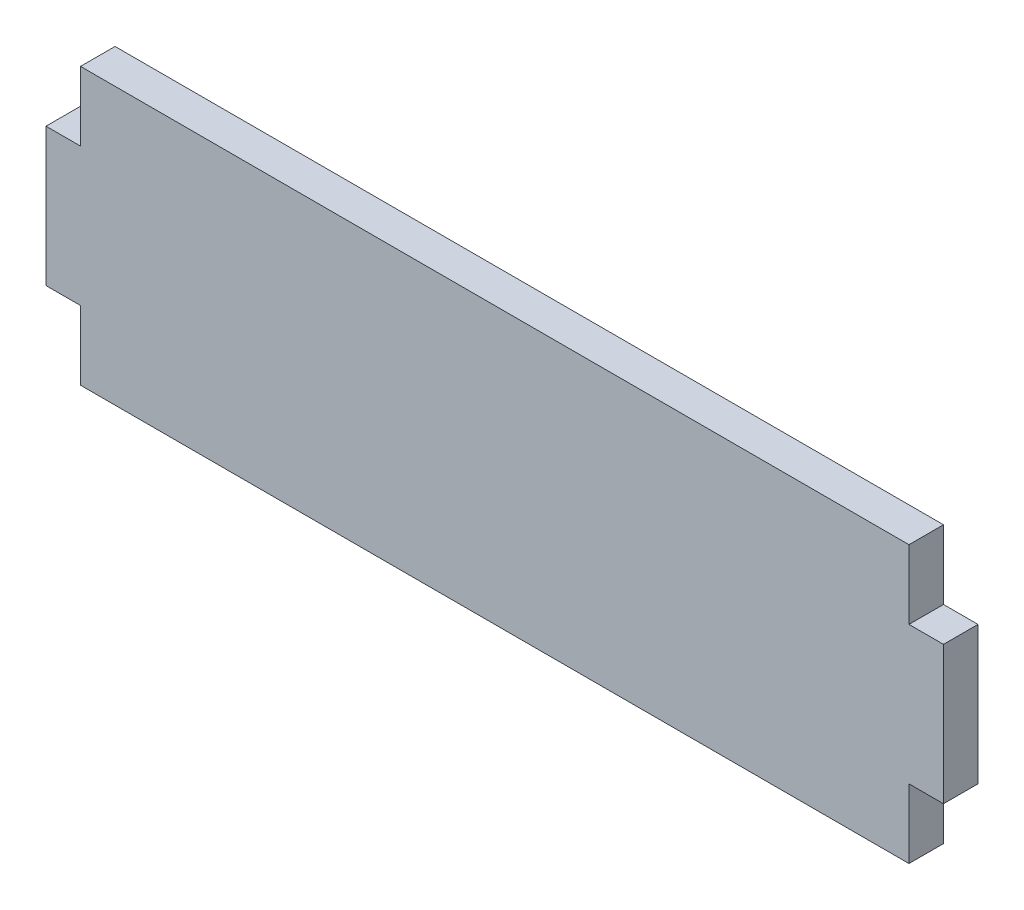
ISO-10303-21;
HEADER;
FILE_DESCRIPTION(('STEP AP214'),'2;1');
FILE_NAME('part.step','',(''),(''),'','','');
FILE_SCHEMA(('AUTOMOTIVE_DESIGN { 1 0 10303 214 1 1 1 1 }'));
ENDSEC;
DATA;
#1=APPLICATION_CONTEXT('core data for automotive mechanical design processes');
#2=APPLICATION_PROTOCOL_DEFINITION('international standard','automotive_design',2000,#1);
#3=PRODUCT_CONTEXT('',#1,'mechanical');
#4=PRODUCT('Part','Part','',(#3));
#5=PRODUCT_RELATED_PRODUCT_CATEGORY('part','',(#4));
#6=PRODUCT_DEFINITION_FORMATION('','',#4);
#7=PRODUCT_DEFINITION_CONTEXT('part definition',#1,'design');
#8=PRODUCT_DEFINITION('design','',#6,#7);
#9=PRODUCT_DEFINITION_SHAPE('','',#8);
#10=(LENGTH_UNIT() NAMED_UNIT(*) SI_UNIT(.MILLI.,.METRE.));
#11=(NAMED_UNIT(*) PLANE_ANGLE_UNIT() SI_UNIT($,.RADIAN.));
#12=(NAMED_UNIT(*) SI_UNIT($,.STERADIAN.) SOLID_ANGLE_UNIT());
#13=UNCERTAINTY_MEASURE_WITH_UNIT(LENGTH_MEASURE(1.E-05),#10,'distance_accuracy_value','');
#14=(GEOMETRIC_REPRESENTATION_CONTEXT(3) GLOBAL_UNCERTAINTY_ASSIGNED_CONTEXT((#13)) GLOBAL_UNIT_ASSIGNED_CONTEXT((#10,
#11,#12)) REPRESENTATION_CONTEXT('',''));
#15=CARTESIAN_POINT('',(0.,0.,0.));
#16=DIRECTION('',(0.,0.,1.));
#17=DIRECTION('',(1.,0.,0.));
#18=AXIS2_PLACEMENT_3D('',#15,#16,#17);
#19=CARTESIAN_POINT('',(0.,-12.7,3.175));
#20=DIRECTION('',(0.,1.,0.));
#21=DIRECTION('',(0.,0.,1.));
#22=AXIS2_PLACEMENT_3D('',#19,#20,#21);
#23=PLANE('',#22);
#24=DIRECTION('',(1.,0.,0.));
#25=VECTOR('',#24,1.);
#26=CARTESIAN_POINT('',(0.,-12.7,0.));
#27=LINE('',#26,#25);
#28=CARTESIAN_POINT('',(-38.1,-12.7,0.));
#29=VERTEX_POINT('',#28);
#30=CARTESIAN_POINT('',(38.1,-12.7,0.));
#31=VERTEX_POINT('',#30);
#32=EDGE_CURVE('E155',#29,#31,#27,.T.);
#33=ORIENTED_EDGE('',*,*,#32,.T.);
#34=DIRECTION('',(0.,0.,-1.));
#35=VECTOR('',#34,1.);
#36=CARTESIAN_POINT('',(38.1,-12.7,3.175));
#37=LINE('',#36,#35);
#38=CARTESIAN_POINT('',(38.1,-12.7,3.175));
#39=VERTEX_POINT('',#38);
#40=EDGE_CURVE('E11',#39,#31,#37,.T.);
#41=ORIENTED_EDGE('',*,*,#40,.F.);
#42=DIRECTION('',(1.,0.,0.));
#43=VECTOR('',#42,1.);
#44=CARTESIAN_POINT('',(0.,-12.7,3.175));
#45=LINE('',#44,#43);
#46=CARTESIAN_POINT('',(-38.1,-12.7,3.175));
#47=VERTEX_POINT('',#46);
#48=EDGE_CURVE('E186',#47,#39,#45,.T.);
#49=ORIENTED_EDGE('',*,*,#48,.F.);
#50=DIRECTION('',(0.,0.,-1.));
#51=VECTOR('',#50,1.);
#52=CARTESIAN_POINT('',(-38.1,-12.7,3.175));
#53=LINE('',#52,#51);
#54=EDGE_CURVE('E49',#47,#29,#53,.T.);
#55=ORIENTED_EDGE('',*,*,#54,.T.);
#56=EDGE_LOOP('',(#33,#41,#49,#55));
#57=FACE_BOUND('',#56,.T.);
#58=ADVANCED_FACE('F33',(#57),#23,.F.);
#59=CARTESIAN_POINT('',(38.1,0.,3.175));
#60=DIRECTION('',(-1.,0.,0.));
#61=DIRECTION('',(0.,0.,1.));
#62=AXIS2_PLACEMENT_3D('',#59,#60,#61);
#63=PLANE('',#62);
#64=DIRECTION('',(0.,1.,0.));
#65=VECTOR('',#64,1.);
#66=CARTESIAN_POINT('',(38.1,0.,0.));
#67=LINE('',#66,#65);
#68=CARTESIAN_POINT('',(38.1,-6.35,0.));
#69=VERTEX_POINT('',#68);
#70=EDGE_CURVE('E157',#31,#69,#67,.T.);
#71=ORIENTED_EDGE('',*,*,#70,.T.);
#72=DIRECTION('',(0.,0.,-1.));
#73=VECTOR('',#72,1.);
#74=CARTESIAN_POINT('',(38.1,-6.35,3.175));
#75=LINE('',#74,#73);
#76=CARTESIAN_POINT('',(38.1,-6.35,3.175));
#77=VERTEX_POINT('',#76);
#78=EDGE_CURVE('E41',#77,#69,#75,.T.);
#79=ORIENTED_EDGE('',*,*,#78,.F.);
#80=DIRECTION('',(0.,1.,0.));
#81=VECTOR('',#80,1.);
#82=CARTESIAN_POINT('',(38.1,0.,3.175));
#83=LINE('',#82,#81);
#84=EDGE_CURVE('E100',#39,#77,#83,.T.);
#85=ORIENTED_EDGE('',*,*,#84,.F.);
#86=ORIENTED_EDGE('',*,*,#40,.T.);
#87=EDGE_LOOP('',(#71,#79,#85,#86));
#88=FACE_BOUND('',#87,.T.);
#89=ADVANCED_FACE('F208',(#88),#63,.F.);
#90=CARTESIAN_POINT('',(0.,-6.35,3.175));
#91=DIRECTION('',(0.,-1.,0.));
#92=DIRECTION('',(0.,0.,-1.));
#93=AXIS2_PLACEMENT_3D('',#90,#91,#92);
#94=PLANE('',#93);
#95=DIRECTION('',(-1.,0.,0.));
#96=VECTOR('',#95,1.);
#97=CARTESIAN_POINT('',(0.,-6.35,0.));
#98=LINE('',#97,#96);
#99=CARTESIAN_POINT('',(41.275,-6.35,0.));
#100=VERTEX_POINT('',#99);
#101=EDGE_CURVE('E160',#100,#69,#98,.T.);
#102=ORIENTED_EDGE('',*,*,#101,.F.);
#103=DIRECTION('',(0.,0.,-1.));
#104=VECTOR('',#103,1.);
#105=CARTESIAN_POINT('',(41.275,-6.35,3.175));
#106=LINE('',#105,#104);
#107=CARTESIAN_POINT('',(41.275,-6.35,3.175));
#108=VERTEX_POINT('',#107);
#109=EDGE_CURVE('E201',#108,#100,#106,.T.);
#110=ORIENTED_EDGE('',*,*,#109,.F.);
#111=DIRECTION('',(-1.,0.,0.));
#112=VECTOR('',#111,1.);
#113=CARTESIAN_POINT('',(0.,-6.35,3.175));
#114=LINE('',#113,#112);
#115=EDGE_CURVE('E207',#108,#77,#114,.T.);
#116=ORIENTED_EDGE('',*,*,#115,.T.);
#117=ORIENTED_EDGE('',*,*,#78,.T.);
#118=EDGE_LOOP('',(#102,#110,#116,#117));
#119=FACE_BOUND('',#118,.T.);
#120=ADVANCED_FACE('F205',(#119),#94,.T.);
#121=CARTESIAN_POINT('',(41.275,0.,3.175));
#122=DIRECTION('',(-1.,0.,0.));
#123=DIRECTION('',(0.,0.,1.));
#124=AXIS2_PLACEMENT_3D('',#121,#122,#123);
#125=PLANE('',#124);
#126=DIRECTION('',(0.,1.,0.));
#127=VECTOR('',#126,1.);
#128=CARTESIAN_POINT('',(41.275,0.,0.));
#129=LINE('',#128,#127);
#130=CARTESIAN_POINT('',(41.275,6.35,0.));
#131=VERTEX_POINT('',#130);
#132=EDGE_CURVE('E163',#100,#131,#129,.T.);
#133=ORIENTED_EDGE('',*,*,#132,.T.);
#134=DIRECTION('',(0.,0.,-1.));
#135=VECTOR('',#134,1.);
#136=CARTESIAN_POINT('',(41.275,6.35,3.175));
#137=LINE('',#136,#135);
#138=CARTESIAN_POINT('',(41.275,6.35,3.175));
#139=VERTEX_POINT('',#138);
#140=EDGE_CURVE('E198',#139,#131,#137,.T.);
#141=ORIENTED_EDGE('',*,*,#140,.F.);
#142=DIRECTION('',(0.,1.,0.));
#143=VECTOR('',#142,1.);
#144=CARTESIAN_POINT('',(41.275,0.,3.175));
#145=LINE('',#144,#143);
#146=EDGE_CURVE('E226',#108,#139,#145,.T.);
#147=ORIENTED_EDGE('',*,*,#146,.F.);
#148=ORIENTED_EDGE('',*,*,#109,.T.);
#149=EDGE_LOOP('',(#133,#141,#147,#148));
#150=FACE_BOUND('',#149,.T.);
#151=ADVANCED_FACE('F216',(#150),#125,.F.);
#152=CARTESIAN_POINT('',(0.,6.35,3.175));
#153=DIRECTION('',(0.,-1.,0.));
#154=DIRECTION('',(0.,0.,-1.));
#155=AXIS2_PLACEMENT_3D('',#152,#153,#154);
#156=PLANE('',#155);
#157=DIRECTION('',(-1.,0.,0.));
#158=VECTOR('',#157,1.);
#159=CARTESIAN_POINT('',(0.,6.35,0.));
#160=LINE('',#159,#158);
#161=CARTESIAN_POINT('',(38.1,6.35,0.));
#162=VERTEX_POINT('',#161);
#163=EDGE_CURVE('E165',#131,#162,#160,.T.);
#164=ORIENTED_EDGE('',*,*,#163,.T.);
#165=DIRECTION('',(0.,0.,-1.));
#166=VECTOR('',#165,1.);
#167=CARTESIAN_POINT('',(38.1,6.35,3.175));
#168=LINE('',#167,#166);
#169=CARTESIAN_POINT('',(38.1,6.35,3.175));
#170=VERTEX_POINT('',#169);
#171=EDGE_CURVE('E196',#170,#162,#168,.T.);
#172=ORIENTED_EDGE('',*,*,#171,.F.);
#173=DIRECTION('',(-1.,0.,0.));
#174=VECTOR('',#173,1.);
#175=CARTESIAN_POINT('',(0.,6.35,3.175));
#176=LINE('',#175,#174);
#177=EDGE_CURVE('E222',#139,#170,#176,.T.);
#178=ORIENTED_EDGE('',*,*,#177,.F.);
#179=ORIENTED_EDGE('',*,*,#140,.T.);
#180=EDGE_LOOP('',(#164,#172,#178,#179));
#181=FACE_BOUND('',#180,.T.);
#182=ADVANCED_FACE('F220',(#181),#156,.F.);
#183=CARTESIAN_POINT('',(38.1,0.,3.175));
#184=DIRECTION('',(1.,0.,0.));
#185=DIRECTION('',(0.,0.,-1.));
#186=AXIS2_PLACEMENT_3D('',#183,#184,#185);
#187=PLANE('',#186);
#188=DIRECTION('',(0.,-1.,0.));
#189=VECTOR('',#188,1.);
#190=CARTESIAN_POINT('',(38.1,0.,0.));
#191=LINE('',#190,#189);
#192=CARTESIAN_POINT('',(38.1,12.7,0.));
#193=VERTEX_POINT('',#192);
#194=EDGE_CURVE('E168',#193,#162,#191,.T.);
#195=ORIENTED_EDGE('',*,*,#194,.F.);
#196=DIRECTION('',(0.,0.,-1.));
#197=VECTOR('',#196,1.);
#198=CARTESIAN_POINT('',(38.1,12.7,3.175));
#199=LINE('',#198,#197);
#200=CARTESIAN_POINT('',(38.1,12.7,3.175));
#201=VERTEX_POINT('',#200);
#202=EDGE_CURVE('E194',#201,#193,#199,.T.);
#203=ORIENTED_EDGE('',*,*,#202,.F.);
#204=DIRECTION('',(0.,-1.,0.));
#205=VECTOR('',#204,1.);
#206=CARTESIAN_POINT('',(38.1,0.,3.175));
#207=LINE('',#206,#205);
#208=EDGE_CURVE('E225',#201,#170,#207,.T.);
#209=ORIENTED_EDGE('',*,*,#208,.T.);
#210=ORIENTED_EDGE('',*,*,#171,.T.);
#211=EDGE_LOOP('',(#195,#203,#209,#210));
#212=FACE_BOUND('',#211,.T.);
#213=ADVANCED_FACE('F268',(#212),#187,.T.);
#214=CARTESIAN_POINT('',(0.,12.7,3.175));
#215=DIRECTION('',(0.,1.,0.));
#216=DIRECTION('',(0.,0.,1.));
#217=AXIS2_PLACEMENT_3D('',#214,#215,#216);
#218=PLANE('',#217);
#219=DIRECTION('',(1.,0.,0.));
#220=VECTOR('',#219,1.);
#221=CARTESIAN_POINT('',(0.,12.7,0.));
#222=LINE('',#221,#220);
#223=CARTESIAN_POINT('',(-38.1,12.7,0.));
#224=VERTEX_POINT('',#223);
#225=EDGE_CURVE('E171',#224,#193,#222,.T.);
#226=ORIENTED_EDGE('',*,*,#225,.F.);
#227=DIRECTION('',(0.,0.,-1.));
#228=VECTOR('',#227,1.);
#229=CARTESIAN_POINT('',(-38.1,12.7,3.175));
#230=LINE('',#229,#228);
#231=CARTESIAN_POINT('',(-38.1,12.7,3.175));
#232=VERTEX_POINT('',#231);
#233=EDGE_CURVE('E192',#232,#224,#230,.T.);
#234=ORIENTED_EDGE('',*,*,#233,.F.);
#235=DIRECTION('',(1.,0.,0.));
#236=VECTOR('',#235,1.);
#237=CARTESIAN_POINT('',(0.,12.7,3.175));
#238=LINE('',#237,#236);
#239=EDGE_CURVE('E228',#232,#201,#238,.T.);
#240=ORIENTED_EDGE('',*,*,#239,.T.);
#241=ORIENTED_EDGE('',*,*,#202,.T.);
#242=EDGE_LOOP('',(#226,#234,#240,#241));
#243=FACE_BOUND('',#242,.T.);
#244=ADVANCED_FACE('F271',(#243),#218,.T.);
#245=CARTESIAN_POINT('',(-38.1,0.,3.175));
#246=DIRECTION('',(1.,0.,0.));
#247=DIRECTION('',(0.,0.,-1.));
#248=AXIS2_PLACEMENT_3D('',#245,#246,#247);
#249=PLANE('',#248);
#250=DIRECTION('',(0.,-1.,0.));
#251=VECTOR('',#250,1.);
#252=CARTESIAN_POINT('',(-38.1,0.,0.));
#253=LINE('',#252,#251);
#254=CARTESIAN_POINT('',(-38.1,6.35,0.));
#255=VERTEX_POINT('',#254);
#256=EDGE_CURVE('E174',#224,#255,#253,.T.);
#257=ORIENTED_EDGE('',*,*,#256,.T.);
#258=DIRECTION('',(0.,0.,-1.));
#259=VECTOR('',#258,1.);
#260=CARTESIAN_POINT('',(-38.1,6.35,3.175));
#261=LINE('',#260,#259);
#262=CARTESIAN_POINT('',(-38.1,6.35,3.175));
#263=VERTEX_POINT('',#262);
#264=EDGE_CURVE('E190',#263,#255,#261,.T.);
#265=ORIENTED_EDGE('',*,*,#264,.F.);
#266=DIRECTION('',(0.,-1.,0.));
#267=VECTOR('',#266,1.);
#268=CARTESIAN_POINT('',(-38.1,0.,3.175));
#269=LINE('',#268,#267);
#270=EDGE_CURVE('E150',#232,#263,#269,.T.);
#271=ORIENTED_EDGE('',*,*,#270,.F.);
#272=ORIENTED_EDGE('',*,*,#233,.T.);
#273=EDGE_LOOP('',(#257,#265,#271,#272));
#274=FACE_BOUND('',#273,.T.);
#275=ADVANCED_FACE('F238',(#274),#249,.F.);
#276=CARTESIAN_POINT('',(0.,6.35,3.175));
#277=DIRECTION('',(0.,1.,0.));
#278=DIRECTION('',(0.,0.,1.));
#279=AXIS2_PLACEMENT_3D('',#276,#277,#278);
#280=PLANE('',#279);
#281=DIRECTION('',(1.,0.,0.));
#282=VECTOR('',#281,1.);
#283=CARTESIAN_POINT('',(0.,6.35,0.));
#284=LINE('',#283,#282);
#285=CARTESIAN_POINT('',(-41.275,6.35,0.));
#286=VERTEX_POINT('',#285);
#287=EDGE_CURVE('E177',#286,#255,#284,.T.);
#288=ORIENTED_EDGE('',*,*,#287,.F.);
#289=DIRECTION('',(0.,0.,-1.));
#290=VECTOR('',#289,1.);
#291=CARTESIAN_POINT('',(-41.275,6.35,3.175));
#292=LINE('',#291,#290);
#293=CARTESIAN_POINT('',(-41.275,6.35,3.175));
#294=VERTEX_POINT('',#293);
#295=EDGE_CURVE('E137',#294,#286,#292,.T.);
#296=ORIENTED_EDGE('',*,*,#295,.F.);
#297=DIRECTION('',(1.,0.,0.));
#298=VECTOR('',#297,1.);
#299=CARTESIAN_POINT('',(0.,6.35,3.175));
#300=LINE('',#299,#298);
#301=EDGE_CURVE('E148',#294,#263,#300,.T.);
#302=ORIENTED_EDGE('',*,*,#301,.T.);
#303=ORIENTED_EDGE('',*,*,#264,.T.);
#304=EDGE_LOOP('',(#288,#296,#302,#303));
#305=FACE_BOUND('',#304,.T.);
#306=ADVANCED_FACE('F242',(#305),#280,.T.);
#307=CARTESIAN_POINT('',(-41.275,0.,3.175));
#308=DIRECTION('',(-1.,0.,0.));
#309=DIRECTION('',(0.,0.,1.));
#310=AXIS2_PLACEMENT_3D('',#307,#308,#309);
#311=PLANE('',#310);
#312=DIRECTION('',(0.,1.,0.));
#313=VECTOR('',#312,1.);
#314=CARTESIAN_POINT('',(-41.275,0.,0.));
#315=LINE('',#314,#313);
#316=CARTESIAN_POINT('',(-41.275,-6.35,0.));
#317=VERTEX_POINT('',#316);
#318=EDGE_CURVE('E134',#317,#286,#315,.T.);
#319=ORIENTED_EDGE('',*,*,#318,.F.);
#320=DIRECTION('',(0.,0.,-1.));
#321=VECTOR('',#320,1.);
#322=CARTESIAN_POINT('',(-41.275,-6.35,3.175));
#323=LINE('',#322,#321);
#324=CARTESIAN_POINT('',(-41.275,-6.35,3.175));
#325=VERTEX_POINT('',#324);
#326=EDGE_CURVE('E128',#325,#317,#323,.T.);
#327=ORIENTED_EDGE('',*,*,#326,.F.);
#328=DIRECTION('',(0.,1.,0.));
#329=VECTOR('',#328,1.);
#330=CARTESIAN_POINT('',(-41.275,0.,3.175));
#331=LINE('',#330,#329);
#332=EDGE_CURVE('E132',#325,#294,#331,.T.);
#333=ORIENTED_EDGE('',*,*,#332,.T.);
#334=ORIENTED_EDGE('',*,*,#295,.T.);
#335=EDGE_LOOP('',(#319,#327,#333,#334));
#336=FACE_BOUND('',#335,.T.);
#337=ADVANCED_FACE('F130',(#336),#311,.T.);
#338=CARTESIAN_POINT('',(0.,-6.35,3.175));
#339=DIRECTION('',(0.,1.,0.));
#340=DIRECTION('',(0.,0.,1.));
#341=AXIS2_PLACEMENT_3D('',#338,#339,#340);
#342=PLANE('',#341);
#343=DIRECTION('',(1.,0.,0.));
#344=VECTOR('',#343,1.);
#345=CARTESIAN_POINT('',(0.,-6.35,0.));
#346=LINE('',#345,#344);
#347=CARTESIAN_POINT('',(-38.1,-6.35,0.));
#348=VERTEX_POINT('',#347);
#349=EDGE_CURVE('E181',#317,#348,#346,.T.);
#350=ORIENTED_EDGE('',*,*,#349,.T.);
#351=DIRECTION('',(0.,0.,-1.));
#352=VECTOR('',#351,1.);
#353=CARTESIAN_POINT('',(-38.1,-6.35,3.175));
#354=LINE('',#353,#352);
#355=CARTESIAN_POINT('',(-38.1,-6.35,3.175));
#356=VERTEX_POINT('',#355);
#357=EDGE_CURVE('E88',#356,#348,#354,.T.);
#358=ORIENTED_EDGE('',*,*,#357,.F.);
#359=DIRECTION('',(1.,0.,0.));
#360=VECTOR('',#359,1.);
#361=CARTESIAN_POINT('',(0.,-6.35,3.175));
#362=LINE('',#361,#360);
#363=EDGE_CURVE('E139',#325,#356,#362,.T.);
#364=ORIENTED_EDGE('',*,*,#363,.F.);
#365=ORIENTED_EDGE('',*,*,#326,.T.);
#366=EDGE_LOOP('',(#350,#358,#364,#365));
#367=FACE_BOUND('',#366,.T.);
#368=ADVANCED_FACE('F140',(#367),#342,.F.);
#369=CARTESIAN_POINT('',(-38.1,0.,3.175));
#370=DIRECTION('',(-1.,0.,0.));
#371=DIRECTION('',(0.,0.,1.));
#372=AXIS2_PLACEMENT_3D('',#369,#370,#371);
#373=PLANE('',#372);
#374=DIRECTION('',(0.,1.,0.));
#375=VECTOR('',#374,1.);
#376=CARTESIAN_POINT('',(-38.1,0.,0.));
#377=LINE('',#376,#375);
#378=EDGE_CURVE('E183',#29,#348,#377,.T.);
#379=ORIENTED_EDGE('',*,*,#378,.F.);
#380=ORIENTED_EDGE('',*,*,#54,.F.);
#381=DIRECTION('',(0.,1.,0.));
#382=VECTOR('',#381,1.);
#383=CARTESIAN_POINT('',(-38.1,0.,3.175));
#384=LINE('',#383,#382);
#385=EDGE_CURVE('E143',#47,#356,#384,.T.);
#386=ORIENTED_EDGE('',*,*,#385,.T.);
#387=ORIENTED_EDGE('',*,*,#357,.T.);
#388=EDGE_LOOP('',(#379,#380,#386,#387));
#389=FACE_BOUND('',#388,.T.);
#390=ADVANCED_FACE('F243',(#389),#373,.T.);
#391=CARTESIAN_POINT('',(0.,0.,3.175));
#392=DIRECTION('',(0.,0.,1.));
#393=DIRECTION('',(1.,0.,0.));
#394=AXIS2_PLACEMENT_3D('',#391,#392,#393);
#395=PLANE('',#394);
#396=ORIENTED_EDGE('',*,*,#48,.T.);
#397=ORIENTED_EDGE('',*,*,#84,.T.);
#398=ORIENTED_EDGE('',*,*,#115,.F.);
#399=ORIENTED_EDGE('',*,*,#146,.T.);
#400=ORIENTED_EDGE('',*,*,#177,.T.);
#401=ORIENTED_EDGE('',*,*,#208,.F.);
#402=ORIENTED_EDGE('',*,*,#239,.F.);
#403=ORIENTED_EDGE('',*,*,#270,.T.);
#404=ORIENTED_EDGE('',*,*,#301,.F.);
#405=ORIENTED_EDGE('',*,*,#332,.F.);
#406=ORIENTED_EDGE('',*,*,#363,.T.);
#407=ORIENTED_EDGE('',*,*,#385,.F.);
#408=EDGE_LOOP('',(#396,#397,#398,#399,#400,#401,#402,#403,#404,#405,#406,#407));
#409=FACE_BOUND('',#408,.T.);
#410=ADVANCED_FACE('F146',(#409),#395,.T.);
#411=CARTESIAN_POINT('',(0.,0.,0.));
#412=DIRECTION('',(0.,0.,1.));
#413=DIRECTION('',(1.,0.,0.));
#414=AXIS2_PLACEMENT_3D('',#411,#412,#413);
#415=PLANE('',#414);
#416=ORIENTED_EDGE('',*,*,#32,.F.);
#417=ORIENTED_EDGE('',*,*,#378,.T.);
#418=ORIENTED_EDGE('',*,*,#349,.F.);
#419=ORIENTED_EDGE('',*,*,#318,.T.);
#420=ORIENTED_EDGE('',*,*,#287,.T.);
#421=ORIENTED_EDGE('',*,*,#256,.F.);
#422=ORIENTED_EDGE('',*,*,#225,.T.);
#423=ORIENTED_EDGE('',*,*,#194,.T.);
#424=ORIENTED_EDGE('',*,*,#163,.F.);
#425=ORIENTED_EDGE('',*,*,#132,.F.);
#426=ORIENTED_EDGE('',*,*,#101,.T.);
#427=ORIENTED_EDGE('',*,*,#70,.F.);
#428=EDGE_LOOP('',(#416,#417,#418,#419,#420,#421,#422,#423,#424,#425,#426,#427));
#429=FACE_BOUND('',#428,.T.);
#430=ADVANCED_FACE('F212',(#429),#415,.F.);
#431=CLOSED_SHELL('',(#58,#89,#120,#151,#182,#213,#244,#275,#306,#337,#368,#390,#410,#430));
#432=MANIFOLD_SOLID_BREP('B2',#431);
#433=ADVANCED_BREP_SHAPE_REPRESENTATION('',(#18,#432),#14);
#434=SHAPE_DEFINITION_REPRESENTATION(#9,#433);
ENDSEC;
END-ISO-10303-21;
